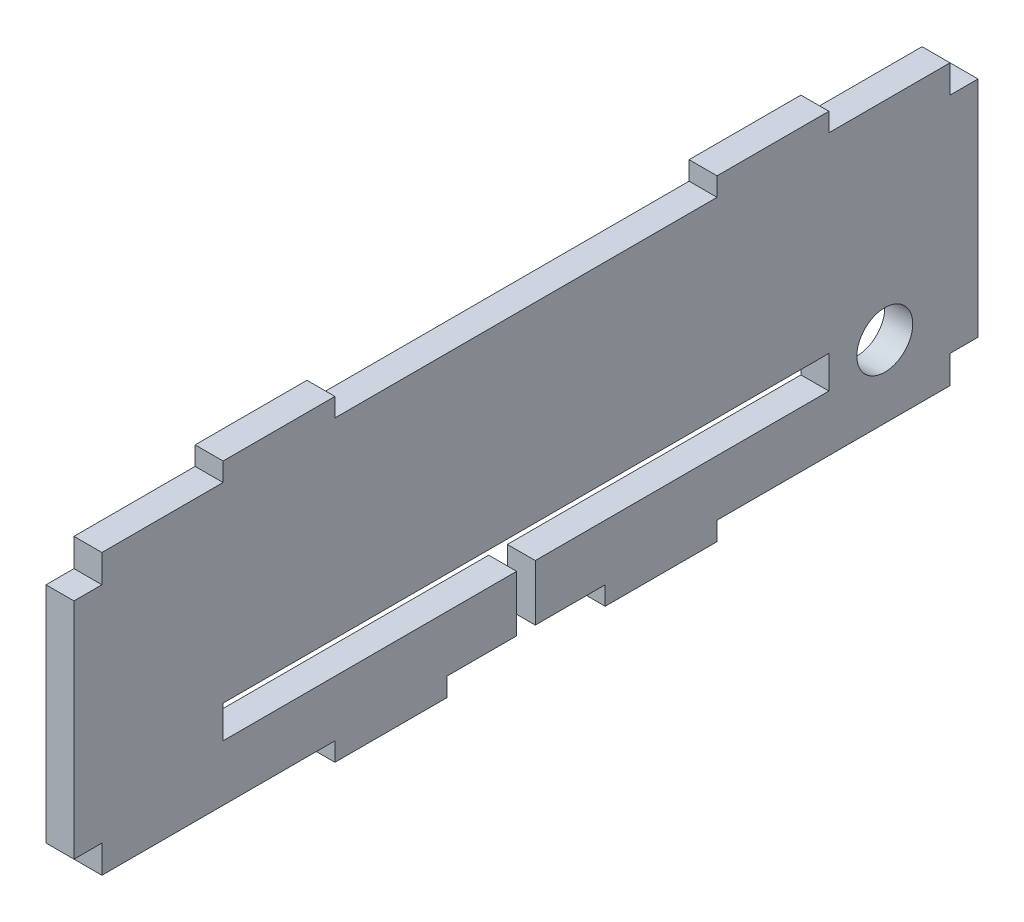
from build123d import *

# Parameters (mm, degrees)
SKETCH1_R           = 3
BOSS_EXTRUDE1_DEPTH = 3


with BuildPart() as part:
    # Sketch1 → Boss-Extrude1 (new body)
    with BuildSketch(Plane(origin=(0, 0, 0), x_dir=(0, 0, -1), z_dir=(1, 0, 0))):
        Polygon((28, 2), (28, 0), (40, 0), (40, 2), (47.5, 2), (47.5, 8), (16, 8), (16, 11.5), (81, 11.5), (81, 8), (49.5, 8), (49.5, 2), (57, 2), (57, 0), (69, 0), (69, 2), (94, 2), (94, 5), (97, 5), (97, 29), (94, 29), (94, 32), (81, 32), (81, 34), (69, 34), (69, 32), (28, 32), (28, 34), (16, 34), (16, 32), (3, 32), (3, 29), (0, 29), (0, 5), (3, 5), (3, 2), align=None)
        with Locations((87, 9.75)):
            Circle(SKETCH1_R, mode=Mode.SUBTRACT)
    extrude(amount=BOSS_EXTRUDE1_DEPTH)


solid = part.part
